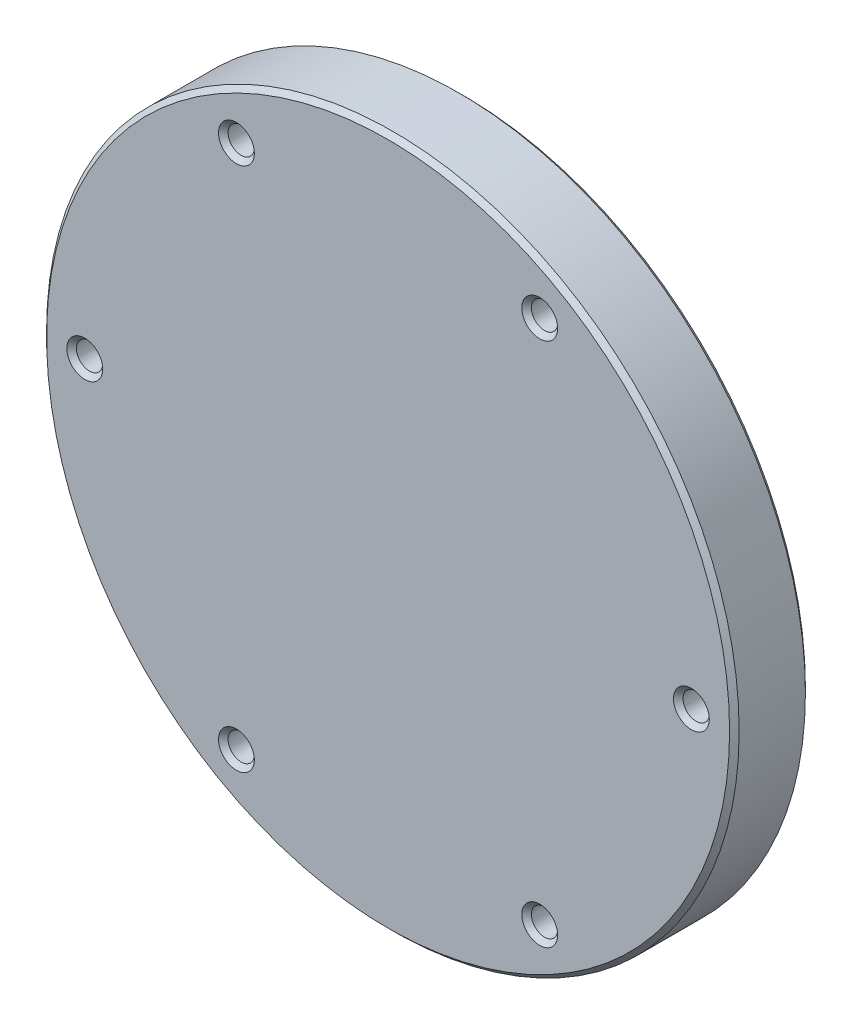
ISO-10303-21;
HEADER;
FILE_DESCRIPTION(('STEP AP214'),'2;1');
FILE_NAME('part.step','',(''),(''),'','','');
FILE_SCHEMA(('AUTOMOTIVE_DESIGN { 1 0 10303 214 1 1 1 1 }'));
ENDSEC;
DATA;
#1=APPLICATION_CONTEXT('core data for automotive mechanical design processes');
#2=APPLICATION_PROTOCOL_DEFINITION('international standard','automotive_design',2000,#1);
#3=PRODUCT_CONTEXT('',#1,'mechanical');
#4=PRODUCT('Part','Part','',(#3));
#5=PRODUCT_RELATED_PRODUCT_CATEGORY('part','',(#4));
#6=PRODUCT_DEFINITION_FORMATION('','',#4);
#7=PRODUCT_DEFINITION_CONTEXT('part definition',#1,'design');
#8=PRODUCT_DEFINITION('design','',#6,#7);
#9=PRODUCT_DEFINITION_SHAPE('','',#8);
#10=(LENGTH_UNIT() NAMED_UNIT(*) SI_UNIT(.MILLI.,.METRE.));
#11=(NAMED_UNIT(*) PLANE_ANGLE_UNIT() SI_UNIT($,.RADIAN.));
#12=(NAMED_UNIT(*) SI_UNIT($,.STERADIAN.) SOLID_ANGLE_UNIT());
#13=UNCERTAINTY_MEASURE_WITH_UNIT(LENGTH_MEASURE(1.E-05),#10,'distance_accuracy_value','');
#14=(GEOMETRIC_REPRESENTATION_CONTEXT(3) GLOBAL_UNCERTAINTY_ASSIGNED_CONTEXT((#13)) GLOBAL_UNIT_ASSIGNED_CONTEXT((#10,
#11,#12)) REPRESENTATION_CONTEXT('',''));
#15=CARTESIAN_POINT('',(0.,0.,0.));
#16=DIRECTION('',(0.,0.,1.));
#17=DIRECTION('',(1.,0.,0.));
#18=AXIS2_PLACEMENT_3D('',#15,#16,#17);
#19=CARTESIAN_POINT('',(-12.7,-21.9970452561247,6.35));
#20=DIRECTION('',(0.,0.,-1.));
#21=DIRECTION('',(-1.,0.,0.));
#22=AXIS2_PLACEMENT_3D('',#19,#20,#21);
#23=CYLINDRICAL_SURFACE('',#22,1.1);
#24=CARTESIAN_POINT('',(-12.7,-21.9970452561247,0.400000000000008));
#25=DIRECTION('',(0.,0.,1.));
#26=DIRECTION('',(1.,0.,0.));
#27=AXIS2_PLACEMENT_3D('',#24,#25,#26);
#28=CIRCLE('',#27,1.1);
#29=CARTESIAN_POINT('',(-11.6,-21.9970452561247,0.400000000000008));
#30=VERTEX_POINT('',#29);
#31=EDGE_CURVE('E123',#30,#30,#28,.F.);
#32=ORIENTED_EDGE('',*,*,#31,.T.);
#33=EDGE_LOOP('',(#32));
#34=FACE_BOUND('',#33,.T.);
#35=CARTESIAN_POINT('',(-12.7,-21.9970452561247,5.95));
#36=DIRECTION('',(0.,0.,1.));
#37=DIRECTION('',(1.,0.,0.));
#38=AXIS2_PLACEMENT_3D('',#35,#36,#37);
#39=CIRCLE('',#38,1.1);
#40=CARTESIAN_POINT('',(-11.6,-21.9970452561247,5.95));
#41=VERTEX_POINT('',#40);
#42=EDGE_CURVE('E127',#41,#41,#39,.T.);
#43=ORIENTED_EDGE('',*,*,#42,.T.);
#44=EDGE_LOOP('',(#43));
#45=FACE_BOUND('',#44,.T.);
#46=ADVANCED_FACE('F45',(#34,#45),#23,.F.);
#47=CARTESIAN_POINT('',(12.7,-21.9970452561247,6.35));
#48=DIRECTION('',(0.,0.,-1.));
#49=DIRECTION('',(-1.,0.,0.));
#50=AXIS2_PLACEMENT_3D('',#47,#48,#49);
#51=CYLINDRICAL_SURFACE('',#50,1.1);
#52=CARTESIAN_POINT('',(12.7,-21.9970452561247,0.400000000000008));
#53=DIRECTION('',(0.,0.,1.));
#54=DIRECTION('',(1.,0.,0.));
#55=AXIS2_PLACEMENT_3D('',#52,#53,#54);
#56=CIRCLE('',#55,1.1);
#57=CARTESIAN_POINT('',(13.8,-21.9970452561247,0.400000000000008));
#58=VERTEX_POINT('',#57);
#59=EDGE_CURVE('E115',#58,#58,#56,.F.);
#60=ORIENTED_EDGE('',*,*,#59,.T.);
#61=EDGE_LOOP('',(#60));
#62=FACE_BOUND('',#61,.T.);
#63=CARTESIAN_POINT('',(12.7,-21.9970452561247,5.95));
#64=DIRECTION('',(0.,0.,1.));
#65=DIRECTION('',(1.,0.,0.));
#66=AXIS2_PLACEMENT_3D('',#63,#64,#65);
#67=CIRCLE('',#66,1.1);
#68=CARTESIAN_POINT('',(13.8,-21.9970452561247,5.95));
#69=VERTEX_POINT('',#68);
#70=EDGE_CURVE('E119',#69,#69,#67,.T.);
#71=ORIENTED_EDGE('',*,*,#70,.T.);
#72=EDGE_LOOP('',(#71));
#73=FACE_BOUND('',#72,.T.);
#74=ADVANCED_FACE('F188',(#62,#73),#51,.F.);
#75=CARTESIAN_POINT('',(25.4,0.,6.35));
#76=DIRECTION('',(0.,0.,-1.));
#77=DIRECTION('',(-1.,0.,0.));
#78=AXIS2_PLACEMENT_3D('',#75,#76,#77);
#79=CYLINDRICAL_SURFACE('',#78,1.10000000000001);
#80=CARTESIAN_POINT('',(25.4,0.,0.399999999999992));
#81=DIRECTION('',(0.,0.,1.));
#82=DIRECTION('',(1.,0.,0.));
#83=AXIS2_PLACEMENT_3D('',#80,#81,#82);
#84=CIRCLE('',#83,1.10000000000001);
#85=CARTESIAN_POINT('',(26.5,0.,0.399999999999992));
#86=VERTEX_POINT('',#85);
#87=EDGE_CURVE('E107',#86,#86,#84,.F.);
#88=ORIENTED_EDGE('',*,*,#87,.T.);
#89=EDGE_LOOP('',(#88));
#90=FACE_BOUND('',#89,.T.);
#91=CARTESIAN_POINT('',(25.4,0.,5.94999999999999));
#92=DIRECTION('',(0.,0.,1.));
#93=DIRECTION('',(1.,0.,0.));
#94=AXIS2_PLACEMENT_3D('',#91,#92,#93);
#95=CIRCLE('',#94,1.10000000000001);
#96=CARTESIAN_POINT('',(26.5,0.,5.94999999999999));
#97=VERTEX_POINT('',#96);
#98=EDGE_CURVE('E111',#97,#97,#95,.T.);
#99=ORIENTED_EDGE('',*,*,#98,.T.);
#100=EDGE_LOOP('',(#99));
#101=FACE_BOUND('',#100,.T.);
#102=ADVANCED_FACE('F194',(#90,#101),#79,.F.);
#103=CARTESIAN_POINT('',(12.7,21.9970452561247,6.35));
#104=DIRECTION('',(0.,0.,-1.));
#105=DIRECTION('',(-1.,0.,0.));
#106=AXIS2_PLACEMENT_3D('',#103,#104,#105);
#107=CYLINDRICAL_SURFACE('',#106,1.1);
#108=CARTESIAN_POINT('',(12.7,21.9970452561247,0.400000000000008));
#109=DIRECTION('',(0.,0.,1.));
#110=DIRECTION('',(1.,0.,0.));
#111=AXIS2_PLACEMENT_3D('',#108,#109,#110);
#112=CIRCLE('',#111,1.1);
#113=CARTESIAN_POINT('',(13.8,21.9970452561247,0.400000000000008));
#114=VERTEX_POINT('',#113);
#115=EDGE_CURVE('E99',#114,#114,#112,.F.);
#116=ORIENTED_EDGE('',*,*,#115,.T.);
#117=EDGE_LOOP('',(#116));
#118=FACE_BOUND('',#117,.T.);
#119=CARTESIAN_POINT('',(12.7,21.9970452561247,5.95));
#120=DIRECTION('',(0.,0.,1.));
#121=DIRECTION('',(1.,0.,0.));
#122=AXIS2_PLACEMENT_3D('',#119,#120,#121);
#123=CIRCLE('',#122,1.1);
#124=CARTESIAN_POINT('',(13.8,21.9970452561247,5.95));
#125=VERTEX_POINT('',#124);
#126=EDGE_CURVE('E103',#125,#125,#123,.T.);
#127=ORIENTED_EDGE('',*,*,#126,.T.);
#128=EDGE_LOOP('',(#127));
#129=FACE_BOUND('',#128,.T.);
#130=ADVANCED_FACE('F203',(#118,#129),#107,.F.);
#131=CARTESIAN_POINT('',(-12.7,21.9970452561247,6.35));
#132=DIRECTION('',(0.,0.,-1.));
#133=DIRECTION('',(-1.,0.,0.));
#134=AXIS2_PLACEMENT_3D('',#131,#132,#133);
#135=CYLINDRICAL_SURFACE('',#134,1.1);
#136=CARTESIAN_POINT('',(-12.7,21.9970452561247,0.40000000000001));
#137=DIRECTION('',(0.,0.,1.));
#138=DIRECTION('',(1.,0.,0.));
#139=AXIS2_PLACEMENT_3D('',#136,#137,#138);
#140=CIRCLE('',#139,1.1);
#141=CARTESIAN_POINT('',(-13.8,21.9970452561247,0.40000000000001));
#142=VERTEX_POINT('',#141);
#143=EDGE_CURVE('E91',#142,#142,#140,.F.);
#144=ORIENTED_EDGE('',*,*,#143,.T.);
#145=EDGE_LOOP('',(#144));
#146=FACE_BOUND('',#145,.T.);
#147=CARTESIAN_POINT('',(-12.7,21.9970452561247,5.95));
#148=DIRECTION('',(0.,0.,1.));
#149=DIRECTION('',(1.,0.,0.));
#150=AXIS2_PLACEMENT_3D('',#147,#148,#149);
#151=CIRCLE('',#150,1.1);
#152=CARTESIAN_POINT('',(-11.6,21.9970452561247,5.95));
#153=VERTEX_POINT('',#152);
#154=EDGE_CURVE('E95',#153,#153,#151,.T.);
#155=ORIENTED_EDGE('',*,*,#154,.T.);
#156=EDGE_LOOP('',(#155));
#157=FACE_BOUND('',#156,.T.);
#158=ADVANCED_FACE('F207',(#146,#157),#135,.F.);
#159=CARTESIAN_POINT('',(-25.4,0.,6.35));
#160=DIRECTION('',(0.,0.,-1.));
#161=DIRECTION('',(-1.,0.,0.));
#162=AXIS2_PLACEMENT_3D('',#159,#160,#161);
#163=CYLINDRICAL_SURFACE('',#162,1.1);
#164=CARTESIAN_POINT('',(-25.4,0.,0.399999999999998));
#165=DIRECTION('',(0.,0.,1.));
#166=DIRECTION('',(1.,0.,0.));
#167=AXIS2_PLACEMENT_3D('',#164,#165,#166);
#168=CIRCLE('',#167,1.1);
#169=CARTESIAN_POINT('',(-26.5,0.,0.399999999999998));
#170=VERTEX_POINT('',#169);
#171=EDGE_CURVE('E83',#170,#170,#168,.F.);
#172=ORIENTED_EDGE('',*,*,#171,.T.);
#173=EDGE_LOOP('',(#172));
#174=FACE_BOUND('',#173,.T.);
#175=CARTESIAN_POINT('',(-25.4,0.,5.95));
#176=DIRECTION('',(0.,0.,1.));
#177=DIRECTION('',(1.,0.,0.));
#178=AXIS2_PLACEMENT_3D('',#175,#176,#177);
#179=CIRCLE('',#178,1.1);
#180=CARTESIAN_POINT('',(-24.3,0.,5.95));
#181=VERTEX_POINT('',#180);
#182=EDGE_CURVE('E87',#181,#181,#179,.T.);
#183=ORIENTED_EDGE('',*,*,#182,.T.);
#184=EDGE_LOOP('',(#183));
#185=FACE_BOUND('',#184,.T.);
#186=ADVANCED_FACE('F211',(#174,#185),#163,.F.);
#187=CARTESIAN_POINT('',(0.,0.,6.35));
#188=DIRECTION('',(0.,0.,-1.));
#189=DIRECTION('',(-1.,0.,0.));
#190=AXIS2_PLACEMENT_3D('',#187,#188,#189);
#191=CYLINDRICAL_SURFACE('',#190,29.);
#192=CARTESIAN_POINT('',(0.,0.,0.400000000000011));
#193=DIRECTION('',(0.,0.,1.));
#194=DIRECTION('',(1.,0.,0.));
#195=AXIS2_PLACEMENT_3D('',#192,#193,#194);
#196=CIRCLE('',#195,29.);
#197=CARTESIAN_POINT('',(29.,0.,0.400000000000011));
#198=VERTEX_POINT('',#197);
#199=EDGE_CURVE('E159',#198,#198,#196,.T.);
#200=ORIENTED_EDGE('',*,*,#199,.T.);
#201=EDGE_LOOP('',(#200));
#202=FACE_BOUND('',#201,.T.);
#203=CARTESIAN_POINT('',(0.,0.,5.94999999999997));
#204=DIRECTION('',(0.,0.,1.));
#205=DIRECTION('',(1.,0.,0.));
#206=AXIS2_PLACEMENT_3D('',#203,#204,#205);
#207=CIRCLE('',#206,29.);
#208=CARTESIAN_POINT('',(29.,0.,5.94999999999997));
#209=VERTEX_POINT('',#208);
#210=EDGE_CURVE('E163',#209,#209,#207,.F.);
#211=ORIENTED_EDGE('',*,*,#210,.T.);
#212=EDGE_LOOP('',(#211));
#213=FACE_BOUND('',#212,.T.);
#214=ADVANCED_FACE('F169',(#202,#213),#191,.T.);
#215=CARTESIAN_POINT('',(0.,0.,6.35));
#216=DIRECTION('',(0.,0.,1.));
#217=DIRECTION('',(1.,0.,0.));
#218=AXIS2_PLACEMENT_3D('',#215,#216,#217);
#219=PLANE('',#218);
#220=CARTESIAN_POINT('',(0.,0.,6.35));
#221=DIRECTION('',(0.,0.,1.));
#222=DIRECTION('',(1.,0.,0.));
#223=AXIS2_PLACEMENT_3D('',#220,#221,#222);
#224=CIRCLE('',#223,28.6);
#225=CARTESIAN_POINT('',(28.6,0.,6.35));
#226=VERTEX_POINT('',#225);
#227=EDGE_CURVE('E10',#226,#226,#224,.T.);
#228=ORIENTED_EDGE('',*,*,#227,.T.);
#229=EDGE_LOOP('',(#228));
#230=FACE_BOUND('',#229,.T.);
#231=CARTESIAN_POINT('',(-12.7,-21.9970452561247,6.35));
#232=DIRECTION('',(0.,0.,1.));
#233=DIRECTION('',(1.,0.,0.));
#234=AXIS2_PLACEMENT_3D('',#231,#232,#233);
#235=CIRCLE('',#234,1.5);
#236=CARTESIAN_POINT('',(-11.2,-21.9970452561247,6.35));
#237=VERTEX_POINT('',#236);
#238=EDGE_CURVE('E53',#237,#237,#235,.F.);
#239=ORIENTED_EDGE('',*,*,#238,.T.);
#240=EDGE_LOOP('',(#239));
#241=FACE_BOUND('',#240,.T.);
#242=CARTESIAN_POINT('',(12.7,-21.9970452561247,6.35));
#243=DIRECTION('',(0.,0.,1.));
#244=DIRECTION('',(1.,0.,0.));
#245=AXIS2_PLACEMENT_3D('',#242,#243,#244);
#246=CIRCLE('',#245,1.5);
#247=CARTESIAN_POINT('',(14.2,-21.9970452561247,6.35));
#248=VERTEX_POINT('',#247);
#249=EDGE_CURVE('E59',#248,#248,#246,.F.);
#250=ORIENTED_EDGE('',*,*,#249,.T.);
#251=EDGE_LOOP('',(#250));
#252=FACE_BOUND('',#251,.T.);
#253=CARTESIAN_POINT('',(25.4,0.,6.35));
#254=DIRECTION('',(0.,0.,1.));
#255=DIRECTION('',(1.,0.,0.));
#256=AXIS2_PLACEMENT_3D('',#253,#254,#255);
#257=CIRCLE('',#256,1.50000000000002);
#258=CARTESIAN_POINT('',(26.9,0.,6.35));
#259=VERTEX_POINT('',#258);
#260=EDGE_CURVE('E65',#259,#259,#257,.F.);
#261=ORIENTED_EDGE('',*,*,#260,.T.);
#262=EDGE_LOOP('',(#261));
#263=FACE_BOUND('',#262,.T.);
#264=CARTESIAN_POINT('',(12.7,21.9970452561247,6.35));
#265=DIRECTION('',(0.,0.,1.));
#266=DIRECTION('',(1.,0.,0.));
#267=AXIS2_PLACEMENT_3D('',#264,#265,#266);
#268=CIRCLE('',#267,1.5);
#269=CARTESIAN_POINT('',(14.2,21.9970452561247,6.35));
#270=VERTEX_POINT('',#269);
#271=EDGE_CURVE('E71',#270,#270,#268,.F.);
#272=ORIENTED_EDGE('',*,*,#271,.T.);
#273=EDGE_LOOP('',(#272));
#274=FACE_BOUND('',#273,.T.);
#275=CARTESIAN_POINT('',(-12.7,21.9970452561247,6.35));
#276=DIRECTION('',(0.,0.,1.));
#277=DIRECTION('',(1.,0.,0.));
#278=AXIS2_PLACEMENT_3D('',#275,#276,#277);
#279=CIRCLE('',#278,1.5);
#280=CARTESIAN_POINT('',(-11.2,21.9970452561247,6.35));
#281=VERTEX_POINT('',#280);
#282=EDGE_CURVE('E75',#281,#281,#279,.F.);
#283=ORIENTED_EDGE('',*,*,#282,.T.);
#284=EDGE_LOOP('',(#283));
#285=FACE_BOUND('',#284,.T.);
#286=CARTESIAN_POINT('',(-25.4,0.,6.35));
#287=DIRECTION('',(0.,0.,1.));
#288=DIRECTION('',(1.,0.,0.));
#289=AXIS2_PLACEMENT_3D('',#286,#287,#288);
#290=CIRCLE('',#289,1.5);
#291=CARTESIAN_POINT('',(-23.9,0.,6.35));
#292=VERTEX_POINT('',#291);
#293=EDGE_CURVE('E79',#292,#292,#290,.F.);
#294=ORIENTED_EDGE('',*,*,#293,.T.);
#295=EDGE_LOOP('',(#294));
#296=FACE_BOUND('',#295,.T.);
#297=ADVANCED_FACE('F247',(#230,#241,#252,#263,#274,#285,#296),#219,.T.);
#298=CARTESIAN_POINT('',(0.,0.,0.));
#299=DIRECTION('',(0.,0.,1.));
#300=DIRECTION('',(1.,0.,0.));
#301=AXIS2_PLACEMENT_3D('',#298,#299,#300);
#302=PLANE('',#301);
#303=CARTESIAN_POINT('',(0.,0.,0.));
#304=DIRECTION('',(0.,0.,1.));
#305=DIRECTION('',(1.,0.,0.));
#306=AXIS2_PLACEMENT_3D('',#303,#304,#305);
#307=CIRCLE('',#306,28.6);
#308=CARTESIAN_POINT('',(28.6,0.,0.));
#309=VERTEX_POINT('',#308);
#310=EDGE_CURVE('E131',#309,#309,#307,.F.);
#311=ORIENTED_EDGE('',*,*,#310,.T.);
#312=EDGE_LOOP('',(#311));
#313=FACE_BOUND('',#312,.T.);
#314=CARTESIAN_POINT('',(-12.7,-21.9970452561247,0.));
#315=DIRECTION('',(0.,0.,1.));
#316=DIRECTION('',(1.,0.,0.));
#317=AXIS2_PLACEMENT_3D('',#314,#315,#316);
#318=CIRCLE('',#317,1.50000000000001);
#319=CARTESIAN_POINT('',(-11.2,-21.9970452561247,0.));
#320=VERTEX_POINT('',#319);
#321=EDGE_CURVE('E135',#320,#320,#318,.T.);
#322=ORIENTED_EDGE('',*,*,#321,.T.);
#323=EDGE_LOOP('',(#322));
#324=FACE_BOUND('',#323,.T.);
#325=CARTESIAN_POINT('',(12.7,-21.9970452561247,0.));
#326=DIRECTION('',(0.,0.,1.));
#327=DIRECTION('',(1.,0.,0.));
#328=AXIS2_PLACEMENT_3D('',#325,#326,#327);
#329=CIRCLE('',#328,1.50000000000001);
#330=CARTESIAN_POINT('',(14.2,-21.9970452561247,0.));
#331=VERTEX_POINT('',#330);
#332=EDGE_CURVE('E139',#331,#331,#329,.T.);
#333=ORIENTED_EDGE('',*,*,#332,.T.);
#334=EDGE_LOOP('',(#333));
#335=FACE_BOUND('',#334,.T.);
#336=CARTESIAN_POINT('',(25.4,0.,0.));
#337=DIRECTION('',(0.,0.,1.));
#338=DIRECTION('',(1.,0.,0.));
#339=AXIS2_PLACEMENT_3D('',#336,#337,#338);
#340=CIRCLE('',#339,1.49999999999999);
#341=CARTESIAN_POINT('',(26.9,0.,0.));
#342=VERTEX_POINT('',#341);
#343=EDGE_CURVE('E143',#342,#342,#340,.T.);
#344=ORIENTED_EDGE('',*,*,#343,.T.);
#345=EDGE_LOOP('',(#344));
#346=FACE_BOUND('',#345,.T.);
#347=CARTESIAN_POINT('',(12.7,21.9970452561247,0.));
#348=DIRECTION('',(0.,0.,1.));
#349=DIRECTION('',(1.,0.,0.));
#350=AXIS2_PLACEMENT_3D('',#347,#348,#349);
#351=CIRCLE('',#350,1.50000000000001);
#352=CARTESIAN_POINT('',(14.2,21.9970452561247,0.));
#353=VERTEX_POINT('',#352);
#354=EDGE_CURVE('E147',#353,#353,#351,.T.);
#355=ORIENTED_EDGE('',*,*,#354,.T.);
#356=EDGE_LOOP('',(#355));
#357=FACE_BOUND('',#356,.T.);
#358=CARTESIAN_POINT('',(-12.7,21.9970452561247,0.));
#359=DIRECTION('',(0.,0.,1.));
#360=DIRECTION('',(1.,0.,0.));
#361=AXIS2_PLACEMENT_3D('',#358,#359,#360);
#362=CIRCLE('',#361,1.50000000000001);
#363=CARTESIAN_POINT('',(-14.2,21.9970452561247,0.));
#364=VERTEX_POINT('',#363);
#365=EDGE_CURVE('E151',#364,#364,#362,.T.);
#366=ORIENTED_EDGE('',*,*,#365,.T.);
#367=EDGE_LOOP('',(#366));
#368=FACE_BOUND('',#367,.T.);
#369=CARTESIAN_POINT('',(-25.4,0.,0.));
#370=DIRECTION('',(0.,0.,1.));
#371=DIRECTION('',(1.,0.,0.));
#372=AXIS2_PLACEMENT_3D('',#369,#370,#371);
#373=CIRCLE('',#372,1.49999999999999);
#374=CARTESIAN_POINT('',(-26.9,0.,0.));
#375=VERTEX_POINT('',#374);
#376=EDGE_CURVE('E155',#375,#375,#373,.T.);
#377=ORIENTED_EDGE('',*,*,#376,.T.);
#378=EDGE_LOOP('',(#377));
#379=FACE_BOUND('',#378,.T.);
#380=ADVANCED_FACE('F220',(#313,#324,#335,#346,#357,#368,#379),#302,.F.);
#381=CARTESIAN_POINT('',(0.,0.,0.400000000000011));
#382=DIRECTION('',(0.,0.,1.));
#383=DIRECTION('',(1.,0.,0.));
#384=AXIS2_PLACEMENT_3D('',#381,#382,#383);
#385=CONICAL_SURFACE('',#384,29.,0.785398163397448);
#386=ORIENTED_EDGE('',*,*,#310,.F.);
#387=EDGE_LOOP('',(#386));
#388=FACE_BOUND('',#387,.T.);
#389=ORIENTED_EDGE('',*,*,#199,.F.);
#390=EDGE_LOOP('',(#389));
#391=FACE_BOUND('',#390,.T.);
#392=ADVANCED_FACE('F216',(#388,#391),#385,.T.);
#393=CARTESIAN_POINT('',(-12.7,-21.9970452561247,0.));
#394=DIRECTION('',(0.,0.,-1.));
#395=DIRECTION('',(-1.,0.,0.));
#396=AXIS2_PLACEMENT_3D('',#393,#394,#395);
#397=CONICAL_SURFACE('',#396,1.50000000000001,0.785398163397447);
#398=ORIENTED_EDGE('',*,*,#31,.F.);
#399=EDGE_LOOP('',(#398));
#400=FACE_BOUND('',#399,.T.);
#401=ORIENTED_EDGE('',*,*,#321,.F.);
#402=EDGE_LOOP('',(#401));
#403=FACE_BOUND('',#402,.T.);
#404=ADVANCED_FACE('F219',(#400,#403),#397,.F.);
#405=CARTESIAN_POINT('',(12.7,-21.9970452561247,0.));
#406=DIRECTION('',(0.,0.,-1.));
#407=DIRECTION('',(-1.,0.,0.));
#408=AXIS2_PLACEMENT_3D('',#405,#406,#407);
#409=CONICAL_SURFACE('',#408,1.50000000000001,0.785398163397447);
#410=ORIENTED_EDGE('',*,*,#59,.F.);
#411=EDGE_LOOP('',(#410));
#412=FACE_BOUND('',#411,.T.);
#413=ORIENTED_EDGE('',*,*,#332,.F.);
#414=EDGE_LOOP('',(#413));
#415=FACE_BOUND('',#414,.T.);
#416=ADVANCED_FACE('F224',(#412,#415),#409,.F.);
#417=CARTESIAN_POINT('',(25.4,0.,0.));
#418=DIRECTION('',(0.,0.,-1.));
#419=DIRECTION('',(-1.,0.,0.));
#420=AXIS2_PLACEMENT_3D('',#417,#418,#419);
#421=CONICAL_SURFACE('',#420,1.49999999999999,0.785398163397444);
#422=ORIENTED_EDGE('',*,*,#87,.F.);
#423=EDGE_LOOP('',(#422));
#424=FACE_BOUND('',#423,.T.);
#425=ORIENTED_EDGE('',*,*,#343,.F.);
#426=EDGE_LOOP('',(#425));
#427=FACE_BOUND('',#426,.T.);
#428=ADVANCED_FACE('F228',(#424,#427),#421,.F.);
#429=CARTESIAN_POINT('',(12.7,21.9970452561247,0.));
#430=DIRECTION('',(0.,0.,-1.));
#431=DIRECTION('',(-1.,0.,0.));
#432=AXIS2_PLACEMENT_3D('',#429,#430,#431);
#433=CONICAL_SURFACE('',#432,1.50000000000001,0.785398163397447);
#434=ORIENTED_EDGE('',*,*,#115,.F.);
#435=EDGE_LOOP('',(#434));
#436=FACE_BOUND('',#435,.T.);
#437=ORIENTED_EDGE('',*,*,#354,.F.);
#438=EDGE_LOOP('',(#437));
#439=FACE_BOUND('',#438,.T.);
#440=ADVANCED_FACE('F232',(#436,#439),#433,.F.);
#441=CARTESIAN_POINT('',(-12.7,21.9970452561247,0.));
#442=DIRECTION('',(0.,0.,-1.));
#443=DIRECTION('',(-1.,0.,0.));
#444=AXIS2_PLACEMENT_3D('',#441,#442,#443);
#445=CONICAL_SURFACE('',#444,1.50000000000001,0.785398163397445);
#446=CARTESIAN_POINT('',(-13.8,21.9970452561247,0.40000000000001));
#447=CARTESIAN_POINT('',(-13.8041666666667,21.9970452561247,0.395833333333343));
#448=CARTESIAN_POINT('',(-13.8083333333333,21.9970452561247,0.391666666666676));
#449=CARTESIAN_POINT('',(-13.8166666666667,21.9970452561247,0.383333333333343));
#450=CARTESIAN_POINT('',(-13.8208333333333,21.9970452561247,0.379166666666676));
#451=CARTESIAN_POINT('',(-13.8291666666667,21.9970452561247,0.370833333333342));
#452=CARTESIAN_POINT('',(-13.8333333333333,21.9970452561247,0.366666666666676));
#453=CARTESIAN_POINT('',(-13.8416666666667,21.9970452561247,0.358333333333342));
#454=CARTESIAN_POINT('',(-13.8458333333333,21.9970452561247,0.354166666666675));
#455=CARTESIAN_POINT('',(-13.8541666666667,21.9970452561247,0.345833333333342));
#456=CARTESIAN_POINT('',(-13.8583333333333,21.9970452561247,0.341666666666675));
#457=CARTESIAN_POINT('',(-13.8666666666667,21.9970452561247,0.333333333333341));
#458=CARTESIAN_POINT('',(-13.8708333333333,21.9970452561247,0.329166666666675));
#459=CARTESIAN_POINT('',(-13.8791666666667,21.9970452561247,0.320833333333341));
#460=CARTESIAN_POINT('',(-13.8833333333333,21.9970452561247,0.316666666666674));
#461=CARTESIAN_POINT('',(-13.8916666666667,21.9970452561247,0.308333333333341));
#462=CARTESIAN_POINT('',(-13.8958333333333,21.9970452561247,0.304166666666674));
#463=CARTESIAN_POINT('',(-13.9041666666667,21.9970452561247,0.29583333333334));
#464=CARTESIAN_POINT('',(-13.9083333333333,21.9970452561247,0.291666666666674));
#465=CARTESIAN_POINT('',(-13.9166666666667,21.9970452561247,0.28333333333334));
#466=CARTESIAN_POINT('',(-13.9208333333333,21.9970452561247,0.279166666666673));
#467=CARTESIAN_POINT('',(-13.9291666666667,21.9970452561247,0.27083333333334));
#468=CARTESIAN_POINT('',(-13.9333333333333,21.9970452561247,0.266666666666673));
#469=CARTESIAN_POINT('',(-13.9416666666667,21.9970452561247,0.25833333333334));
#470=CARTESIAN_POINT('',(-13.9458333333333,21.9970452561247,0.254166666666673));
#471=CARTESIAN_POINT('',(-13.9541666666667,21.9970452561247,0.245833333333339));
#472=CARTESIAN_POINT('',(-13.9583333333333,21.9970452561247,0.241666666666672));
#473=CARTESIAN_POINT('',(-13.9666666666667,21.9970452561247,0.233333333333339));
#474=CARTESIAN_POINT('',(-13.9708333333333,21.9970452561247,0.229166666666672));
#475=CARTESIAN_POINT('',(-13.9791666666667,21.9970452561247,0.220833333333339));
#476=CARTESIAN_POINT('',(-13.9833333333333,21.9970452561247,0.216666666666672));
#477=CARTESIAN_POINT('',(-13.9916666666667,21.9970452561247,0.208333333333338));
#478=CARTESIAN_POINT('',(-13.9958333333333,21.9970452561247,0.204166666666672));
#479=CARTESIAN_POINT('',(-14.0041666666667,21.9970452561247,0.195833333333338));
#480=CARTESIAN_POINT('',(-14.0083333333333,21.9970452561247,0.191666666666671));
#481=CARTESIAN_POINT('',(-14.0166666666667,21.9970452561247,0.183333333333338));
#482=CARTESIAN_POINT('',(-14.0208333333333,21.9970452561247,0.179166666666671));
#483=CARTESIAN_POINT('',(-14.0291666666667,21.9970452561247,0.170833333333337));
#484=CARTESIAN_POINT('',(-14.0333333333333,21.9970452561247,0.166666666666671));
#485=CARTESIAN_POINT('',(-14.0416666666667,21.9970452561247,0.158333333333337));
#486=CARTESIAN_POINT('',(-14.0458333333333,21.9970452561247,0.15416666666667));
#487=CARTESIAN_POINT('',(-14.0541666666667,21.9970452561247,0.145833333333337));
#488=CARTESIAN_POINT('',(-14.0583333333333,21.9970452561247,0.14166666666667));
#489=CARTESIAN_POINT('',(-14.0666666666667,21.9970452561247,0.133333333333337));
#490=CARTESIAN_POINT('',(-14.0708333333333,21.9970452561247,0.12916666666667));
#491=CARTESIAN_POINT('',(-14.0791666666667,21.9970452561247,0.120833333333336));
#492=CARTESIAN_POINT('',(-14.0833333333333,21.9970452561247,0.116666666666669));
#493=CARTESIAN_POINT('',(-14.0916666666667,21.9970452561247,0.108333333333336));
#494=CARTESIAN_POINT('',(-14.0958333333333,21.9970452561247,0.104166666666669));
#495=CARTESIAN_POINT('',(-14.1041666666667,21.9970452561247,0.0958333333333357));
#496=CARTESIAN_POINT('',(-14.1083333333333,21.9970452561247,0.0916666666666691));
#497=CARTESIAN_POINT('',(-14.1166666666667,21.9970452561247,0.0833333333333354));
#498=CARTESIAN_POINT('',(-14.1208333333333,21.9970452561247,0.0791666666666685));
#499=CARTESIAN_POINT('',(-14.1291666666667,21.9970452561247,0.0708333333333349));
#500=CARTESIAN_POINT('',(-14.1333333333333,21.9970452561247,0.0666666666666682));
#501=CARTESIAN_POINT('',(-14.1416666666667,21.9970452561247,0.0583333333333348));
#502=CARTESIAN_POINT('',(-14.1458333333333,21.9970452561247,0.054166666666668));
#503=CARTESIAN_POINT('',(-14.1541666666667,21.9970452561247,0.0458333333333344));
#504=CARTESIAN_POINT('',(-14.1583333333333,21.9970452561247,0.0416666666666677));
#505=CARTESIAN_POINT('',(-14.1666666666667,21.9970452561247,0.0333333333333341));
#506=CARTESIAN_POINT('',(-14.1708333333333,21.9970452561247,0.0291666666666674));
#507=CARTESIAN_POINT('',(-14.1791666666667,21.9970452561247,0.0208333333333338));
#508=CARTESIAN_POINT('',(-14.1833333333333,21.9970452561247,0.0166666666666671));
#509=CARTESIAN_POINT('',(-14.1916666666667,21.9970452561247,0.00833333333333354));
#510=CARTESIAN_POINT('',(-14.1958333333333,21.9970452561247,0.00416666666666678));
#511=CARTESIAN_POINT('',(-14.2,21.9970452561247,0.));
#512=B_SPLINE_CURVE_WITH_KNOTS('',3,(#446,#447,#448,#449,#450,#451,#452,#453,#454,#455,#456,
#457,#458,#459,#460,#461,#462,#463,#464,#465,#466,#467,#468,#469,#470,#471,#472,#473,#474,#475,
#476,#477,#478,#479,#480,#481,#482,#483,#484,#485,#486,#487,#488,#489,#490,#491,#492,#493,#494,
#495,#496,#497,#498,#499,#500,#501,#502,#503,#504,#505,#506,#507,#508,#509,#510,#511),
.UNSPECIFIED.,.F.,.F.,(4,2,2,2,2,2,2,2,2,2,2,2,2,2,2,2,2,2,2,2,2,2,2,2,2,2,2,2,2,2,2,2,4),(0.,
0.0176776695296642,0.0353553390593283,0.0530330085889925,0.0707106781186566,0.0883883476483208,
0.106066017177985,0.123743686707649,0.141421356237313,0.159099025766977,0.176776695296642,
0.194454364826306,0.21213203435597,0.229809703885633,0.247487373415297,0.265165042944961,
0.282842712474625,0.300520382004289,0.318198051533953,0.335875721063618,0.353553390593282,
0.371231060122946,0.38890872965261,0.406586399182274,0.424264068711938,0.441941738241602,
0.459619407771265,0.47729707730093,0.494974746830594,0.512652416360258,0.530330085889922,
0.548007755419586,0.56568542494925),.UNSPECIFIED.);
#513=EDGE_CURVE('BSEAM184',#142,#364,#512,.T.);
#514=ORIENTED_EDGE('',*,*,#143,.F.);
#515=ORIENTED_EDGE('',*,*,#365,.F.);
#516=ORIENTED_EDGE('',*,*,#513,.T.);
#517=ORIENTED_EDGE('',*,*,#513,.F.);
#518=EDGE_LOOP('',(#514,#516,#515,#517));
#519=FACE_BOUND('',#518,.T.);
#520=ADVANCED_FACE('F184',(#519),#445,.F.);
#521=CARTESIAN_POINT('',(-25.4,0.,0.));
#522=DIRECTION('',(0.,0.,-1.));
#523=DIRECTION('',(-1.,0.,0.));
#524=AXIS2_PLACEMENT_3D('',#521,#522,#523);
#525=CONICAL_SURFACE('',#524,1.49999999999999,0.785398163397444);
#526=CARTESIAN_POINT('',(-26.5,0.,0.399999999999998));
#527=CARTESIAN_POINT('',(-26.5041666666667,0.,0.395833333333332));
#528=CARTESIAN_POINT('',(-26.5083333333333,0.,0.391666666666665));
#529=CARTESIAN_POINT('',(-26.5166666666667,0.,0.383333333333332));
#530=CARTESIAN_POINT('',(-26.5208333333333,0.,0.379166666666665));
#531=CARTESIAN_POINT('',(-26.5291666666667,0.,0.370833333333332));
#532=CARTESIAN_POINT('',(-26.5333333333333,0.,0.366666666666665));
#533=CARTESIAN_POINT('',(-26.5416666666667,0.,0.358333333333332));
#534=CARTESIAN_POINT('',(-26.5458333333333,0.,0.354166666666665));
#535=CARTESIAN_POINT('',(-26.5541666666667,0.,0.345833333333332));
#536=CARTESIAN_POINT('',(-26.5583333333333,0.,0.341666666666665));
#537=CARTESIAN_POINT('',(-26.5666666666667,0.,0.333333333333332));
#538=CARTESIAN_POINT('',(-26.5708333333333,0.,0.329166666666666));
#539=CARTESIAN_POINT('',(-26.5791666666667,0.,0.320833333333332));
#540=CARTESIAN_POINT('',(-26.5833333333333,0.,0.316666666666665));
#541=CARTESIAN_POINT('',(-26.5916666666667,0.,0.308333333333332));
#542=CARTESIAN_POINT('',(-26.5958333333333,0.,0.304166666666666));
#543=CARTESIAN_POINT('',(-26.6041666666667,0.,0.295833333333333));
#544=CARTESIAN_POINT('',(-26.6083333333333,0.,0.291666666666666));
#545=CARTESIAN_POINT('',(-26.6166666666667,0.,0.283333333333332));
#546=CARTESIAN_POINT('',(-26.6208333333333,0.,0.279166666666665));
#547=CARTESIAN_POINT('',(-26.6291666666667,0.,0.270833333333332));
#548=CARTESIAN_POINT('',(-26.6333333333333,0.,0.266666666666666));
#549=CARTESIAN_POINT('',(-26.6416666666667,0.,0.258333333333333));
#550=CARTESIAN_POINT('',(-26.6458333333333,0.,0.254166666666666));
#551=CARTESIAN_POINT('',(-26.6541666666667,0.,0.245833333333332));
#552=CARTESIAN_POINT('',(-26.6583333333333,0.,0.241666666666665));
#553=CARTESIAN_POINT('',(-26.6666666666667,0.,0.233333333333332));
#554=CARTESIAN_POINT('',(-26.6708333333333,0.,0.229166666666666));
#555=CARTESIAN_POINT('',(-26.6791666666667,0.,0.220833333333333));
#556=CARTESIAN_POINT('',(-26.6833333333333,0.,0.216666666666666));
#557=CARTESIAN_POINT('',(-26.6916666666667,0.,0.208333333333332));
#558=CARTESIAN_POINT('',(-26.6958333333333,0.,0.204166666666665));
#559=CARTESIAN_POINT('',(-26.7041666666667,0.,0.195833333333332));
#560=CARTESIAN_POINT('',(-26.7083333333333,0.,0.191666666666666));
#561=CARTESIAN_POINT('',(-26.7166666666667,0.,0.183333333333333));
#562=CARTESIAN_POINT('',(-26.7208333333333,0.,0.179166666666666));
#563=CARTESIAN_POINT('',(-26.7291666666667,0.,0.170833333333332));
#564=CARTESIAN_POINT('',(-26.7333333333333,0.,0.166666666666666));
#565=CARTESIAN_POINT('',(-26.7416666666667,0.,0.158333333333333));
#566=CARTESIAN_POINT('',(-26.7458333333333,0.,0.154166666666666));
#567=CARTESIAN_POINT('',(-26.7541666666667,0.,0.145833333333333));
#568=CARTESIAN_POINT('',(-26.7583333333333,0.,0.141666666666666));
#569=CARTESIAN_POINT('',(-26.7666666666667,0.,0.133333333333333));
#570=CARTESIAN_POINT('',(-26.7708333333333,0.,0.129166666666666));
#571=CARTESIAN_POINT('',(-26.7791666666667,0.,0.120833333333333));
#572=CARTESIAN_POINT('',(-26.7833333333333,0.,0.116666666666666));
#573=CARTESIAN_POINT('',(-26.7916666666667,0.,0.108333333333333));
#574=CARTESIAN_POINT('',(-26.7958333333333,0.,0.104166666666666));
#575=CARTESIAN_POINT('',(-26.8041666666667,0.,0.0958333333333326));
#576=CARTESIAN_POINT('',(-26.8083333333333,0.,0.0916666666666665));
#577=CARTESIAN_POINT('',(-26.8166666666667,0.,0.0833333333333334));
#578=CARTESIAN_POINT('',(-26.8208333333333,0.,0.0791666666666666));
#579=CARTESIAN_POINT('',(-26.8291666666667,0.,0.0708333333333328));
#580=CARTESIAN_POINT('',(-26.8333333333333,0.,0.066666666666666));
#581=CARTESIAN_POINT('',(-26.8416666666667,0.,0.0583333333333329));
#582=CARTESIAN_POINT('',(-26.8458333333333,0.,0.0541666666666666));
#583=CARTESIAN_POINT('',(-26.8541666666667,0.,0.0458333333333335));
#584=CARTESIAN_POINT('',(-26.8583333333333,0.,0.0416666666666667));
#585=CARTESIAN_POINT('',(-26.8666666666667,0.,0.033333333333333));
#586=CARTESIAN_POINT('',(-26.8708333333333,0.,0.0291666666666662));
#587=CARTESIAN_POINT('',(-26.8791666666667,0.,0.020833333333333));
#588=CARTESIAN_POINT('',(-26.8833333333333,0.,0.0166666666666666));
#589=CARTESIAN_POINT('',(-26.8916666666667,0.,0.00833333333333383));
#590=CARTESIAN_POINT('',(-26.8958333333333,0.,0.00416666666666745));
#591=CARTESIAN_POINT('',(-26.9,0.,0.));
#592=B_SPLINE_CURVE_WITH_KNOTS('',3,(#526,#527,#528,#529,#530,#531,#532,#533,#534,#535,#536,
#537,#538,#539,#540,#541,#542,#543,#544,#545,#546,#547,#548,#549,#550,#551,#552,#553,#554,#555,
#556,#557,#558,#559,#560,#561,#562,#563,#564,#565,#566,#567,#568,#569,#570,#571,#572,#573,#574,
#575,#576,#577,#578,#579,#580,#581,#582,#583,#584,#585,#586,#587,#588,#589,#590,#591),
.UNSPECIFIED.,.F.,.F.,(4,2,2,2,2,2,2,2,2,2,2,2,2,2,2,2,2,2,2,2,2,2,2,2,2,2,2,2,2,2,2,2,4),(0.,
0.0176776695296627,0.0353553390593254,0.0530330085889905,0.0707106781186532,0.0883883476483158,
0.106066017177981,0.123743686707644,0.141421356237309,0.159099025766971,0.176776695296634,
0.194454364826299,0.212132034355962,0.229809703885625,0.24748737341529,0.265165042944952,
0.282842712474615,0.30052038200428,0.318198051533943,0.335875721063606,0.353553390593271,
0.371231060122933,0.388908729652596,0.406586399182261,0.424264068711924,0.441941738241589,
0.459619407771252,0.477297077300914,0.49497474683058,0.512652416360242,0.530330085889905,
0.54800775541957,0.565685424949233),.UNSPECIFIED.);
#593=EDGE_CURVE('BSEAM175',#170,#375,#592,.T.);
#594=ORIENTED_EDGE('',*,*,#171,.F.);
#595=ORIENTED_EDGE('',*,*,#376,.F.);
#596=ORIENTED_EDGE('',*,*,#593,.T.);
#597=ORIENTED_EDGE('',*,*,#593,.F.);
#598=EDGE_LOOP('',(#594,#596,#595,#597));
#599=FACE_BOUND('',#598,.T.);
#600=ADVANCED_FACE('F175',(#599),#525,.F.);
#601=CARTESIAN_POINT('',(0.,0.,6.35));
#602=DIRECTION('',(0.,0.,-1.));
#603=DIRECTION('',(-1.,0.,0.));
#604=AXIS2_PLACEMENT_3D('',#601,#602,#603);
#605=CONICAL_SURFACE('',#604,28.6,0.785398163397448);
#606=ORIENTED_EDGE('',*,*,#210,.F.);
#607=EDGE_LOOP('',(#606));
#608=FACE_BOUND('',#607,.T.);
#609=ORIENTED_EDGE('',*,*,#227,.F.);
#610=EDGE_LOOP('',(#609));
#611=FACE_BOUND('',#610,.T.);
#612=ADVANCED_FACE('F171',(#608,#611),#605,.T.);
#613=CARTESIAN_POINT('',(-12.7,-21.9970452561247,5.95));
#614=DIRECTION('',(0.,0.,1.));
#615=DIRECTION('',(1.,0.,0.));
#616=AXIS2_PLACEMENT_3D('',#613,#614,#615);
#617=CONICAL_SURFACE('',#616,1.1,0.78539816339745);
#618=CARTESIAN_POINT('',(-11.2,-21.9970452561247,6.35));
#619=CARTESIAN_POINT('',(-11.2041666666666,-21.9970452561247,6.34583333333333));
#620=CARTESIAN_POINT('',(-11.2083333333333,-21.9970452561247,6.34166666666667));
#621=CARTESIAN_POINT('',(-11.2166666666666,-21.9970452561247,6.33333333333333));
#622=CARTESIAN_POINT('',(-11.2208333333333,-21.9970452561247,6.32916666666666));
#623=CARTESIAN_POINT('',(-11.2291666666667,-21.9970452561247,6.32083333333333));
#624=CARTESIAN_POINT('',(-11.2333333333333,-21.9970452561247,6.31666666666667));
#625=CARTESIAN_POINT('',(-11.2416666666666,-21.9970452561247,6.30833333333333));
#626=CARTESIAN_POINT('',(-11.2458333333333,-21.9970452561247,6.30416666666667));
#627=CARTESIAN_POINT('',(-11.2541666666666,-21.9970452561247,6.29583333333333));
#628=CARTESIAN_POINT('',(-11.2583333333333,-21.9970452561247,6.29166666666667));
#629=CARTESIAN_POINT('',(-11.2666666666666,-21.9970452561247,6.28333333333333));
#630=CARTESIAN_POINT('',(-11.2708333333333,-21.9970452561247,6.27916666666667));
#631=CARTESIAN_POINT('',(-11.2791666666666,-21.9970452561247,6.27083333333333));
#632=CARTESIAN_POINT('',(-11.2833333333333,-21.9970452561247,6.26666666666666));
#633=CARTESIAN_POINT('',(-11.2916666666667,-21.9970452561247,6.25833333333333));
#634=CARTESIAN_POINT('',(-11.2958333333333,-21.9970452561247,6.25416666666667));
#635=CARTESIAN_POINT('',(-11.3041666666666,-21.9970452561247,6.24583333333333));
#636=CARTESIAN_POINT('',(-11.3083333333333,-21.9970452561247,6.24166666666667));
#637=CARTESIAN_POINT('',(-11.3166666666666,-21.9970452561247,6.23333333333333));
#638=CARTESIAN_POINT('',(-11.3208333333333,-21.9970452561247,6.22916666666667));
#639=CARTESIAN_POINT('',(-11.3291666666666,-21.9970452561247,6.22083333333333));
#640=CARTESIAN_POINT('',(-11.3333333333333,-21.9970452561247,6.21666666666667));
#641=CARTESIAN_POINT('',(-11.3416666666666,-21.9970452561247,6.20833333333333));
#642=CARTESIAN_POINT('',(-11.3458333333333,-21.9970452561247,6.20416666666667));
#643=CARTESIAN_POINT('',(-11.3541666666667,-21.9970452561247,6.19583333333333));
#644=CARTESIAN_POINT('',(-11.3583333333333,-21.9970452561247,6.19166666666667));
#645=CARTESIAN_POINT('',(-11.3666666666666,-21.9970452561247,6.18333333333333));
#646=CARTESIAN_POINT('',(-11.3708333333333,-21.9970452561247,6.17916666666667));
#647=CARTESIAN_POINT('',(-11.3791666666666,-21.9970452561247,6.17083333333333));
#648=CARTESIAN_POINT('',(-11.3833333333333,-21.9970452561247,6.16666666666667));
#649=CARTESIAN_POINT('',(-11.3916666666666,-21.9970452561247,6.15833333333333));
#650=CARTESIAN_POINT('',(-11.3958333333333,-21.9970452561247,6.15416666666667));
#651=CARTESIAN_POINT('',(-11.4041666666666,-21.9970452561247,6.14583333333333));
#652=CARTESIAN_POINT('',(-11.4083333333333,-21.9970452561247,6.14166666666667));
#653=CARTESIAN_POINT('',(-11.4166666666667,-21.9970452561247,6.13333333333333));
#654=CARTESIAN_POINT('',(-11.4208333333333,-21.9970452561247,6.12916666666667));
#655=CARTESIAN_POINT('',(-11.4291666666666,-21.9970452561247,6.12083333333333));
#656=CARTESIAN_POINT('',(-11.4333333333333,-21.9970452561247,6.11666666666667));
#657=CARTESIAN_POINT('',(-11.4416666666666,-21.9970452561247,6.10833333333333));
#658=CARTESIAN_POINT('',(-11.4458333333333,-21.9970452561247,6.10416666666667));
#659=CARTESIAN_POINT('',(-11.4541666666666,-21.9970452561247,6.09583333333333));
#660=CARTESIAN_POINT('',(-11.4583333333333,-21.9970452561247,6.09166666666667));
#661=CARTESIAN_POINT('',(-11.4666666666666,-21.9970452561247,6.08333333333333));
#662=CARTESIAN_POINT('',(-11.4708333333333,-21.9970452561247,6.07916666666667));
#663=CARTESIAN_POINT('',(-11.4791666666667,-21.9970452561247,6.07083333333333));
#664=CARTESIAN_POINT('',(-11.4833333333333,-21.9970452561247,6.06666666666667));
#665=CARTESIAN_POINT('',(-11.4916666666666,-21.9970452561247,6.05833333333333));
#666=CARTESIAN_POINT('',(-11.4958333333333,-21.9970452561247,6.05416666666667));
#667=CARTESIAN_POINT('',(-11.5041666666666,-21.9970452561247,6.04583333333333));
#668=CARTESIAN_POINT('',(-11.5083333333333,-21.9970452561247,6.04166666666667));
#669=CARTESIAN_POINT('',(-11.5166666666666,-21.9970452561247,6.03333333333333));
#670=CARTESIAN_POINT('',(-11.5208333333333,-21.9970452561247,6.02916666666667));
#671=CARTESIAN_POINT('',(-11.5291666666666,-21.9970452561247,6.02083333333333));
#672=CARTESIAN_POINT('',(-11.5333333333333,-21.9970452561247,6.01666666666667));
#673=CARTESIAN_POINT('',(-11.5416666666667,-21.9970452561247,6.00833333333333));
#674=CARTESIAN_POINT('',(-11.5458333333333,-21.9970452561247,6.00416666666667));
#675=CARTESIAN_POINT('',(-11.5541666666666,-21.9970452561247,5.99583333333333));
#676=CARTESIAN_POINT('',(-11.5583333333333,-21.9970452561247,5.99166666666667));
#677=CARTESIAN_POINT('',(-11.5666666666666,-21.9970452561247,5.98333333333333));
#678=CARTESIAN_POINT('',(-11.5708333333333,-21.9970452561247,5.97916666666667));
#679=CARTESIAN_POINT('',(-11.5791666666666,-21.9970452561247,5.97083333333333));
#680=CARTESIAN_POINT('',(-11.5833333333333,-21.9970452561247,5.96666666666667));
#681=CARTESIAN_POINT('',(-11.5916666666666,-21.9970452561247,5.95833333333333));
#682=CARTESIAN_POINT('',(-11.5958333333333,-21.9970452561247,5.95416666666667));
#683=CARTESIAN_POINT('',(-11.6,-21.9970452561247,5.95));
#684=B_SPLINE_CURVE_WITH_KNOTS('',3,(#618,#619,#620,#621,#622,#623,#624,#625,#626,#627,#628,
#629,#630,#631,#632,#633,#634,#635,#636,#637,#638,#639,#640,#641,#642,#643,#644,#645,#646,#647,
#648,#649,#650,#651,#652,#653,#654,#655,#656,#657,#658,#659,#660,#661,#662,#663,#664,#665,#666,
#667,#668,#669,#670,#671,#672,#673,#674,#675,#676,#677,#678,#679,#680,#681,#682,#683),
.UNSPECIFIED.,.F.,.F.,(4,2,2,2,2,2,2,2,2,2,2,2,2,2,2,2,2,2,2,2,2,2,2,2,2,2,2,2,2,2,2,2,4),(0.,
0.0176776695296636,0.0353553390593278,0.0530330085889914,0.0707106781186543,0.0883883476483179,
0.106066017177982,0.123743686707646,0.14142135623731,0.159099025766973,0.176776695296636,
0.194454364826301,0.212132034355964,0.229809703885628,0.247487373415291,0.265165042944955,
0.282842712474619,0.300520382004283,0.318198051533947,0.335875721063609,0.353553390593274,
0.371231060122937,0.388908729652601,0.406586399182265,0.424264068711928,0.441941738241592,
0.459619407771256,0.47729707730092,0.494974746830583,0.512652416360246,0.53033008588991,
0.548007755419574,0.565685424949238),.UNSPECIFIED.);
#685=EDGE_CURVE('BSEAM174',#237,#41,#684,.T.);
#686=ORIENTED_EDGE('',*,*,#238,.F.);
#687=ORIENTED_EDGE('',*,*,#42,.F.);
#688=ORIENTED_EDGE('',*,*,#685,.T.);
#689=ORIENTED_EDGE('',*,*,#685,.F.);
#690=EDGE_LOOP('',(#686,#688,#687,#689));
#691=FACE_BOUND('',#690,.T.);
#692=ADVANCED_FACE('F174',(#691),#617,.F.);
#693=CARTESIAN_POINT('',(12.7,-21.9970452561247,5.95));
#694=DIRECTION('',(0.,0.,1.));
#695=DIRECTION('',(1.,0.,0.));
#696=AXIS2_PLACEMENT_3D('',#693,#694,#695);
#697=CONICAL_SURFACE('',#696,1.1,0.78539816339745);
#698=CARTESIAN_POINT('',(14.2,-21.9970452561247,6.35));
#699=CARTESIAN_POINT('',(14.1958333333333,-21.9970452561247,6.34583333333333));
#700=CARTESIAN_POINT('',(14.1916666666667,-21.9970452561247,6.34166666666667));
#701=CARTESIAN_POINT('',(14.1833333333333,-21.9970452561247,6.33333333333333));
#702=CARTESIAN_POINT('',(14.1791666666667,-21.9970452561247,6.32916666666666));
#703=CARTESIAN_POINT('',(14.1708333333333,-21.9970452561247,6.32083333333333));
#704=CARTESIAN_POINT('',(14.1666666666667,-21.9970452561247,6.31666666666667));
#705=CARTESIAN_POINT('',(14.1583333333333,-21.9970452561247,6.30833333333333));
#706=CARTESIAN_POINT('',(14.1541666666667,-21.9970452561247,6.30416666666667));
#707=CARTESIAN_POINT('',(14.1458333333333,-21.9970452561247,6.29583333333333));
#708=CARTESIAN_POINT('',(14.1416666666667,-21.9970452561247,6.29166666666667));
#709=CARTESIAN_POINT('',(14.1333333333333,-21.9970452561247,6.28333333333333));
#710=CARTESIAN_POINT('',(14.1291666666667,-21.9970452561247,6.27916666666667));
#711=CARTESIAN_POINT('',(14.1208333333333,-21.9970452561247,6.27083333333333));
#712=CARTESIAN_POINT('',(14.1166666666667,-21.9970452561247,6.26666666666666));
#713=CARTESIAN_POINT('',(14.1083333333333,-21.9970452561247,6.25833333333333));
#714=CARTESIAN_POINT('',(14.1041666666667,-21.9970452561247,6.25416666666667));
#715=CARTESIAN_POINT('',(14.0958333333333,-21.9970452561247,6.24583333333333));
#716=CARTESIAN_POINT('',(14.0916666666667,-21.9970452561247,6.24166666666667));
#717=CARTESIAN_POINT('',(14.0833333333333,-21.9970452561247,6.23333333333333));
#718=CARTESIAN_POINT('',(14.0791666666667,-21.9970452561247,6.22916666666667));
#719=CARTESIAN_POINT('',(14.0708333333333,-21.9970452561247,6.22083333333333));
#720=CARTESIAN_POINT('',(14.0666666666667,-21.9970452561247,6.21666666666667));
#721=CARTESIAN_POINT('',(14.0583333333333,-21.9970452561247,6.20833333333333));
#722=CARTESIAN_POINT('',(14.0541666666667,-21.9970452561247,6.20416666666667));
#723=CARTESIAN_POINT('',(14.0458333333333,-21.9970452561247,6.19583333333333));
#724=CARTESIAN_POINT('',(14.0416666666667,-21.9970452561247,6.19166666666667));
#725=CARTESIAN_POINT('',(14.0333333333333,-21.9970452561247,6.18333333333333));
#726=CARTESIAN_POINT('',(14.0291666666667,-21.9970452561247,6.17916666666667));
#727=CARTESIAN_POINT('',(14.0208333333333,-21.9970452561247,6.17083333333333));
#728=CARTESIAN_POINT('',(14.0166666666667,-21.9970452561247,6.16666666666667));
#729=CARTESIAN_POINT('',(14.0083333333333,-21.9970452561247,6.15833333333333));
#730=CARTESIAN_POINT('',(14.0041666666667,-21.9970452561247,6.15416666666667));
#731=CARTESIAN_POINT('',(13.9958333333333,-21.9970452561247,6.14583333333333));
#732=CARTESIAN_POINT('',(13.9916666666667,-21.9970452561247,6.14166666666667));
#733=CARTESIAN_POINT('',(13.9833333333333,-21.9970452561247,6.13333333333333));
#734=CARTESIAN_POINT('',(13.9791666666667,-21.9970452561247,6.12916666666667));
#735=CARTESIAN_POINT('',(13.9708333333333,-21.9970452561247,6.12083333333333));
#736=CARTESIAN_POINT('',(13.9666666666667,-21.9970452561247,6.11666666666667));
#737=CARTESIAN_POINT('',(13.9583333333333,-21.9970452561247,6.10833333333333));
#738=CARTESIAN_POINT('',(13.9541666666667,-21.9970452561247,6.10416666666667));
#739=CARTESIAN_POINT('',(13.9458333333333,-21.9970452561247,6.09583333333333));
#740=CARTESIAN_POINT('',(13.9416666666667,-21.9970452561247,6.09166666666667));
#741=CARTESIAN_POINT('',(13.9333333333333,-21.9970452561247,6.08333333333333));
#742=CARTESIAN_POINT('',(13.9291666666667,-21.9970452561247,6.07916666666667));
#743=CARTESIAN_POINT('',(13.9208333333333,-21.9970452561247,6.07083333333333));
#744=CARTESIAN_POINT('',(13.9166666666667,-21.9970452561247,6.06666666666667));
#745=CARTESIAN_POINT('',(13.9083333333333,-21.9970452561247,6.05833333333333));
#746=CARTESIAN_POINT('',(13.9041666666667,-21.9970452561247,6.05416666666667));
#747=CARTESIAN_POINT('',(13.8958333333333,-21.9970452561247,6.04583333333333));
#748=CARTESIAN_POINT('',(13.8916666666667,-21.9970452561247,6.04166666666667));
#749=CARTESIAN_POINT('',(13.8833333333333,-21.9970452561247,6.03333333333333));
#750=CARTESIAN_POINT('',(13.8791666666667,-21.9970452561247,6.02916666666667));
#751=CARTESIAN_POINT('',(13.8708333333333,-21.9970452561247,6.02083333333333));
#752=CARTESIAN_POINT('',(13.8666666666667,-21.9970452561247,6.01666666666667));
#753=CARTESIAN_POINT('',(13.8583333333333,-21.9970452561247,6.00833333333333));
#754=CARTESIAN_POINT('',(13.8541666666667,-21.9970452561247,6.00416666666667));
#755=CARTESIAN_POINT('',(13.8458333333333,-21.9970452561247,5.99583333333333));
#756=CARTESIAN_POINT('',(13.8416666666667,-21.9970452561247,5.99166666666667));
#757=CARTESIAN_POINT('',(13.8333333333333,-21.9970452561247,5.98333333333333));
#758=CARTESIAN_POINT('',(13.8291666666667,-21.9970452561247,5.97916666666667));
#759=CARTESIAN_POINT('',(13.8208333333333,-21.9970452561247,5.97083333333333));
#760=CARTESIAN_POINT('',(13.8166666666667,-21.9970452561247,5.96666666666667));
#761=CARTESIAN_POINT('',(13.8083333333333,-21.9970452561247,5.95833333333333));
#762=CARTESIAN_POINT('',(13.8041666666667,-21.9970452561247,5.95416666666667));
#763=CARTESIAN_POINT('',(13.8,-21.9970452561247,5.95));
#764=B_SPLINE_CURVE_WITH_KNOTS('',3,(#698,#699,#700,#701,#702,#703,#704,#705,#706,#707,#708,
#709,#710,#711,#712,#713,#714,#715,#716,#717,#718,#719,#720,#721,#722,#723,#724,#725,#726,#727,
#728,#729,#730,#731,#732,#733,#734,#735,#736,#737,#738,#739,#740,#741,#742,#743,#744,#745,#746,
#747,#748,#749,#750,#751,#752,#753,#754,#755,#756,#757,#758,#759,#760,#761,#762,#763),
.UNSPECIFIED.,.F.,.F.,(4,2,2,2,2,2,2,2,2,2,2,2,2,2,2,2,2,2,2,2,2,2,2,2,2,2,2,2,2,2,2,2,4),(0.,
0.0176776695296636,0.0353553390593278,0.0530330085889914,0.0707106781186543,0.0883883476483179,
0.106066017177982,0.123743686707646,0.14142135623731,0.159099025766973,0.176776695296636,
0.194454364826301,0.212132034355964,0.229809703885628,0.247487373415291,0.265165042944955,
0.282842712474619,0.300520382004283,0.318198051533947,0.335875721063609,0.353553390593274,
0.371231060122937,0.388908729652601,0.406586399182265,0.424264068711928,0.441941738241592,
0.459619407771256,0.47729707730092,0.494974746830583,0.512652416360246,0.53033008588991,
0.548007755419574,0.565685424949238),.UNSPECIFIED.);
#765=EDGE_CURVE('BSEAM181',#248,#69,#764,.T.);
#766=ORIENTED_EDGE('',*,*,#249,.F.);
#767=ORIENTED_EDGE('',*,*,#70,.F.);
#768=ORIENTED_EDGE('',*,*,#765,.T.);
#769=ORIENTED_EDGE('',*,*,#765,.F.);
#770=EDGE_LOOP('',(#766,#768,#767,#769));
#771=FACE_BOUND('',#770,.T.);
#772=ADVANCED_FACE('F181',(#771),#697,.F.);
#773=CARTESIAN_POINT('',(25.4,0.,5.94999999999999));
#774=DIRECTION('',(0.,0.,1.));
#775=DIRECTION('',(1.,0.,0.));
#776=AXIS2_PLACEMENT_3D('',#773,#774,#775);
#777=CONICAL_SURFACE('',#776,1.10000000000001,0.785398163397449);
#778=ORIENTED_EDGE('',*,*,#260,.F.);
#779=EDGE_LOOP('',(#778));
#780=FACE_BOUND('',#779,.T.);
#781=ORIENTED_EDGE('',*,*,#98,.F.);
#782=EDGE_LOOP('',(#781));
#783=FACE_BOUND('',#782,.T.);
#784=ADVANCED_FACE('F359',(#780,#783),#777,.F.);
#785=CARTESIAN_POINT('',(12.7,21.9970452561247,5.95));
#786=DIRECTION('',(0.,0.,1.));
#787=DIRECTION('',(1.,0.,0.));
#788=AXIS2_PLACEMENT_3D('',#785,#786,#787);
#789=CONICAL_SURFACE('',#788,1.1,0.78539816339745);
#790=CARTESIAN_POINT('',(14.2,21.9970452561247,6.35));
#791=CARTESIAN_POINT('',(14.1958333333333,21.9970452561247,6.34583333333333));
#792=CARTESIAN_POINT('',(14.1916666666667,21.9970452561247,6.34166666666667));
#793=CARTESIAN_POINT('',(14.1833333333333,21.9970452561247,6.33333333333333));
#794=CARTESIAN_POINT('',(14.1791666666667,21.9970452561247,6.32916666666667));
#795=CARTESIAN_POINT('',(14.1708333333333,21.9970452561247,6.32083333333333));
#796=CARTESIAN_POINT('',(14.1666666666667,21.9970452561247,6.31666666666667));
#797=CARTESIAN_POINT('',(14.1583333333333,21.9970452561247,6.30833333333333));
#798=CARTESIAN_POINT('',(14.1541666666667,21.9970452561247,6.30416666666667));
#799=CARTESIAN_POINT('',(14.1458333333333,21.9970452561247,6.29583333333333));
#800=CARTESIAN_POINT('',(14.1416666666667,21.9970452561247,6.29166666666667));
#801=CARTESIAN_POINT('',(14.1333333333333,21.9970452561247,6.28333333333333));
#802=CARTESIAN_POINT('',(14.1291666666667,21.9970452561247,6.27916666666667));
#803=CARTESIAN_POINT('',(14.1208333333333,21.9970452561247,6.27083333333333));
#804=CARTESIAN_POINT('',(14.1166666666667,21.9970452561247,6.26666666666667));
#805=CARTESIAN_POINT('',(14.1083333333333,21.9970452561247,6.25833333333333));
#806=CARTESIAN_POINT('',(14.1041666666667,21.9970452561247,6.25416666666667));
#807=CARTESIAN_POINT('',(14.0958333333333,21.9970452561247,6.24583333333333));
#808=CARTESIAN_POINT('',(14.0916666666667,21.9970452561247,6.24166666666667));
#809=CARTESIAN_POINT('',(14.0833333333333,21.9970452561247,6.23333333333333));
#810=CARTESIAN_POINT('',(14.0791666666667,21.9970452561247,6.22916666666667));
#811=CARTESIAN_POINT('',(14.0708333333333,21.9970452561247,6.22083333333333));
#812=CARTESIAN_POINT('',(14.0666666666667,21.9970452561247,6.21666666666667));
#813=CARTESIAN_POINT('',(14.0583333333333,21.9970452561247,6.20833333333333));
#814=CARTESIAN_POINT('',(14.0541666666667,21.9970452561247,6.20416666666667));
#815=CARTESIAN_POINT('',(14.0458333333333,21.9970452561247,6.19583333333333));
#816=CARTESIAN_POINT('',(14.0416666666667,21.9970452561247,6.19166666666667));
#817=CARTESIAN_POINT('',(14.0333333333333,21.9970452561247,6.18333333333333));
#818=CARTESIAN_POINT('',(14.0291666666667,21.9970452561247,6.17916666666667));
#819=CARTESIAN_POINT('',(14.0208333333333,21.9970452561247,6.17083333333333));
#820=CARTESIAN_POINT('',(14.0166666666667,21.9970452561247,6.16666666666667));
#821=CARTESIAN_POINT('',(14.0083333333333,21.9970452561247,6.15833333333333));
#822=CARTESIAN_POINT('',(14.0041666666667,21.9970452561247,6.15416666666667));
#823=CARTESIAN_POINT('',(13.9958333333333,21.9970452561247,6.14583333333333));
#824=CARTESIAN_POINT('',(13.9916666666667,21.9970452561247,6.14166666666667));
#825=CARTESIAN_POINT('',(13.9833333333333,21.9970452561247,6.13333333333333));
#826=CARTESIAN_POINT('',(13.9791666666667,21.9970452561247,6.12916666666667));
#827=CARTESIAN_POINT('',(13.9708333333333,21.9970452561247,6.12083333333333));
#828=CARTESIAN_POINT('',(13.9666666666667,21.9970452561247,6.11666666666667));
#829=CARTESIAN_POINT('',(13.9583333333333,21.9970452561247,6.10833333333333));
#830=CARTESIAN_POINT('',(13.9541666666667,21.9970452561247,6.10416666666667));
#831=CARTESIAN_POINT('',(13.9458333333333,21.9970452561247,6.09583333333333));
#832=CARTESIAN_POINT('',(13.9416666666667,21.9970452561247,6.09166666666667));
#833=CARTESIAN_POINT('',(13.9333333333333,21.9970452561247,6.08333333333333));
#834=CARTESIAN_POINT('',(13.9291666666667,21.9970452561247,6.07916666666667));
#835=CARTESIAN_POINT('',(13.9208333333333,21.9970452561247,6.07083333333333));
#836=CARTESIAN_POINT('',(13.9166666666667,21.9970452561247,6.06666666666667));
#837=CARTESIAN_POINT('',(13.9083333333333,21.9970452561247,6.05833333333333));
#838=CARTESIAN_POINT('',(13.9041666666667,21.9970452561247,6.05416666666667));
#839=CARTESIAN_POINT('',(13.8958333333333,21.9970452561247,6.04583333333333));
#840=CARTESIAN_POINT('',(13.8916666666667,21.9970452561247,6.04166666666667));
#841=CARTESIAN_POINT('',(13.8833333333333,21.9970452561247,6.03333333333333));
#842=CARTESIAN_POINT('',(13.8791666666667,21.9970452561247,6.02916666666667));
#843=CARTESIAN_POINT('',(13.8708333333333,21.9970452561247,6.02083333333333));
#844=CARTESIAN_POINT('',(13.8666666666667,21.9970452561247,6.01666666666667));
#845=CARTESIAN_POINT('',(13.8583333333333,21.9970452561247,6.00833333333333));
#846=CARTESIAN_POINT('',(13.8541666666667,21.9970452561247,6.00416666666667));
#847=CARTESIAN_POINT('',(13.8458333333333,21.9970452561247,5.99583333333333));
#848=CARTESIAN_POINT('',(13.8416666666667,21.9970452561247,5.99166666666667));
#849=CARTESIAN_POINT('',(13.8333333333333,21.9970452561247,5.98333333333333));
#850=CARTESIAN_POINT('',(13.8291666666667,21.9970452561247,5.97916666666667));
#851=CARTESIAN_POINT('',(13.8208333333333,21.9970452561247,5.97083333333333));
#852=CARTESIAN_POINT('',(13.8166666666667,21.9970452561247,5.96666666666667));
#853=CARTESIAN_POINT('',(13.8083333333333,21.9970452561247,5.95833333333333));
#854=CARTESIAN_POINT('',(13.8041666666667,21.9970452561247,5.95416666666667));
#855=CARTESIAN_POINT('',(13.8,21.9970452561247,5.95));
#856=B_SPLINE_CURVE_WITH_KNOTS('',3,(#790,#791,#792,#793,#794,#795,#796,#797,#798,#799,#800,
#801,#802,#803,#804,#805,#806,#807,#808,#809,#810,#811,#812,#813,#814,#815,#816,#817,#818,#819,
#820,#821,#822,#823,#824,#825,#826,#827,#828,#829,#830,#831,#832,#833,#834,#835,#836,#837,#838,
#839,#840,#841,#842,#843,#844,#845,#846,#847,#848,#849,#850,#851,#852,#853,#854,#855),
.UNSPECIFIED.,.F.,.F.,(4,2,2,2,2,2,2,2,2,2,2,2,2,2,2,2,2,2,2,2,2,2,2,2,2,2,2,2,2,2,2,2,4),(0.,
0.0176776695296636,0.0353553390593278,0.0530330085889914,0.0707106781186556,0.0883883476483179,
0.106066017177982,0.123743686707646,0.14142135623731,0.159099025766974,0.176776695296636,
0.194454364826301,0.212132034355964,0.229809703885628,0.247487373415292,0.265165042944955,
0.282842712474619,0.300520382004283,0.318198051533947,0.335875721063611,0.353553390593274,
0.371231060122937,0.388908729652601,0.406586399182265,0.424264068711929,0.441941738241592,
0.459619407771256,0.47729707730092,0.494974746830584,0.512652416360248,0.53033008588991,
0.548007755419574,0.565685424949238),.UNSPECIFIED.);
#857=EDGE_CURVE('BSEAM370',#270,#125,#856,.T.);
#858=ORIENTED_EDGE('',*,*,#271,.F.);
#859=ORIENTED_EDGE('',*,*,#126,.F.);
#860=ORIENTED_EDGE('',*,*,#857,.T.);
#861=ORIENTED_EDGE('',*,*,#857,.F.);
#862=EDGE_LOOP('',(#858,#860,#859,#861));
#863=FACE_BOUND('',#862,.T.);
#864=ADVANCED_FACE('F370',(#863),#789,.F.);
#865=CARTESIAN_POINT('',(-12.7,21.9970452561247,5.95));
#866=DIRECTION('',(0.,0.,1.));
#867=DIRECTION('',(1.,0.,0.));
#868=AXIS2_PLACEMENT_3D('',#865,#866,#867);
#869=CONICAL_SURFACE('',#868,1.1,0.785398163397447);
#870=ORIENTED_EDGE('',*,*,#282,.F.);
#871=EDGE_LOOP('',(#870));
#872=FACE_BOUND('',#871,.T.);
#873=ORIENTED_EDGE('',*,*,#154,.F.);
#874=EDGE_LOOP('',(#873));
#875=FACE_BOUND('',#874,.T.);
#876=ADVANCED_FACE('F381',(#872,#875),#869,.F.);
#877=CARTESIAN_POINT('',(-25.4,0.,5.95));
#878=DIRECTION('',(0.,0.,1.));
#879=DIRECTION('',(1.,0.,0.));
#880=AXIS2_PLACEMENT_3D('',#877,#878,#879);
#881=CONICAL_SURFACE('',#880,1.1,0.785398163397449);
#882=ORIENTED_EDGE('',*,*,#293,.F.);
#883=EDGE_LOOP('',(#882));
#884=FACE_BOUND('',#883,.T.);
#885=ORIENTED_EDGE('',*,*,#182,.F.);
#886=EDGE_LOOP('',(#885));
#887=FACE_BOUND('',#886,.T.);
#888=ADVANCED_FACE('F47',(#884,#887),#881,.F.);
#889=CLOSED_SHELL('',(#46,#74,#102,#130,#158,#186,#214,#297,#380,#392,#404,#416,#428,#440,#520,
#600,#612,#692,#772,#784,#864,#876,#888));
#890=MANIFOLD_SOLID_BREP('B2',#889);
#891=ADVANCED_BREP_SHAPE_REPRESENTATION('',(#18,#890),#14);
#892=SHAPE_DEFINITION_REPRESENTATION(#9,#891);
ENDSEC;
END-ISO-10303-21;
